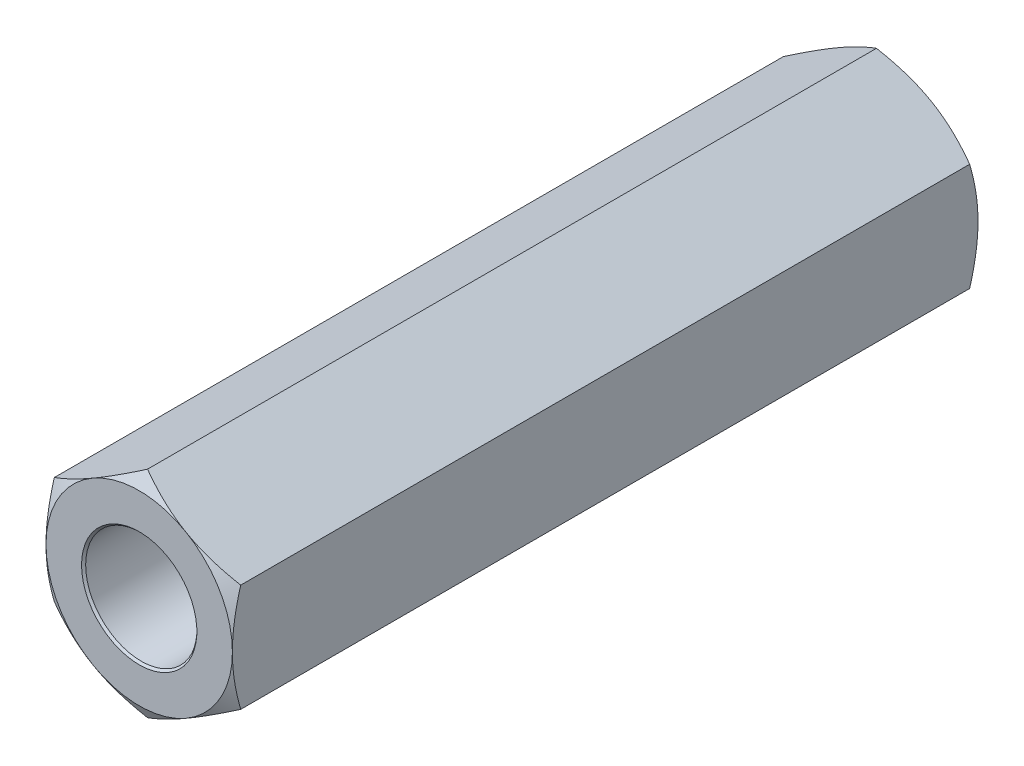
from build123d import *

# Parameters (mm, degrees)
EXTRUDE1_DEPTH          = 9.525
EXTRUDE1_DEPTH_BACK     = 9.525
SKETCH1_R               = 1.4224
SKETCH8_OUTSIDE_W       = 81.488
SKETCH8_OUTSIDE_H       = 82.226
SKETCH8_OUTSIDE_R       = 2.38125
EXTRUDE4_DEPTH          = 20.39415686
EXTRUDE4_DRAFT          = -60
MIRROR1_COPY_1_SKETCH_W = 81.488
MIRROR1_COPY_1_SKETCH_H = 82.226
MIRROR1_COPY_1_SKETCH_R = 2.38125
MIRROR1_COPY_1_DEPTH    = 20.39415686
MIRROR1_COPY_1_DRAFT    = -60


with BuildPart() as part:
    # Sketch1 → Extrude1 (new, two sides: drawn at the far end of the back side and taken through both)
    with BuildSketch(Plane.XY.offset(-EXTRUDE1_DEPTH_BACK)):
        Polygon((0, 2.749630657), (-2.38125, 1.374815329), (-2.38125, -1.374815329), (0, -2.749630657), (2.38125, -1.374815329), (2.38125, 1.374815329), align=None)
        with Locations(Location((0, 0, 0), (0, 0, 180))):
            Circle(SKETCH1_R, mode=Mode.SUBTRACT)
    extrude(amount=EXTRUDE1_DEPTH + EXTRUDE1_DEPTH_BACK)

    # Extrude3 cone 1 section (on through the dimple's axis) → Extrude3 (revolve, cut)
    with BuildSketch(Plane(origin=(0, 0, -9.525), x_dir=(0, 1, 0), z_dir=(1, 0, 0))):
        Polygon((0, 0), (1.4732, 0), (0, 1.579813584), align=None)
    extrude3 = revolve(axis=Axis((0, 0, -9.525), (0, 0, 1)), mode=Mode.SUBTRACT)


with BuildPart() as extrude4_tool:
    # Sketch8 outside → Extrude4 (with draft: the straight prism first)
    with BuildSketch(Plane(origin=(0, 0, -9.525), x_dir=(-1, 0, 0), z_dir=(0, 0, -1))):
        Rectangle(SKETCH8_OUTSIDE_W, SKETCH8_OUTSIDE_H)
        Circle(SKETCH8_OUTSIDE_R, mode=Mode.SUBTRACT)
    extrude(amount=-EXTRUDE4_DEPTH)
    # Extrude4: the draft: its side faces are tilted about the plane it starts from
    extrude4_sides = [extrude4_tool.faces().sort_by_distance(p)[0] for p in [
        (0, -41.113, 0.67207843),
        (-40.744, 0, 0.67207843),
        (0, 41.113, 0.67207843),
        (40.744, 0, 0.67207843),
        (2.38125, 0, 0.67207843),
    ]]
    draft(extrude4_sides, Plane(origin=(0, 0, -9.525), x_dir=(-1, 0, 0), z_dir=(0, 0, -1)), EXTRUDE4_DRAFT)


with BuildPart() as part_1:
    add(part.part)

    # Extrude4: cut by extrude4_tool
    add(extrude4_tool.part, mode=Mode.SUBTRACT)

    # Mirror1: Extrude3 across plane
    add(extrude3.mirror(Plane.XY), mode=Mode.SUBTRACT)


with BuildPart() as mirror1_copy_1_tool:
    # Mirror1 copy 1 sketch → Mirror1 copy 1 (with draft: the straight prism first)
    with BuildSketch(Plane(origin=(0, 0, 9.525), x_dir=(-1, 0, 0), z_dir=(0, 0, 1))):
        Rectangle(MIRROR1_COPY_1_SKETCH_W, MIRROR1_COPY_1_SKETCH_H)
        Circle(MIRROR1_COPY_1_SKETCH_R, mode=Mode.SUBTRACT)
    extrude(amount=-MIRROR1_COPY_1_DEPTH)
    # Mirror1 copy 1: the draft: its side faces are tilted about the plane it starts from
    mirror1_copy_1_sides = [mirror1_copy_1_tool.faces().sort_by_distance(p)[0] for p in [
        (0, -41.113, -0.67207843),
        (-40.744, 0, -0.67207843),
        (0, 41.113, -0.67207843),
        (40.744, 0, -0.67207843),
        (2.38125, 0, -0.67207843),
    ]]
    draft(mirror1_copy_1_sides, Plane(origin=(0, 0, 9.525), x_dir=(-1, 0, 0), z_dir=(0, 0, 1)), MIRROR1_COPY_1_DRAFT)


with BuildPart() as part_2:
    add(part_1.part)

    # Mirror1 copy 1: cut by mirror1_copy_1_tool
    add(mirror1_copy_1_tool.part, mode=Mode.SUBTRACT)


solid = part_2.part
